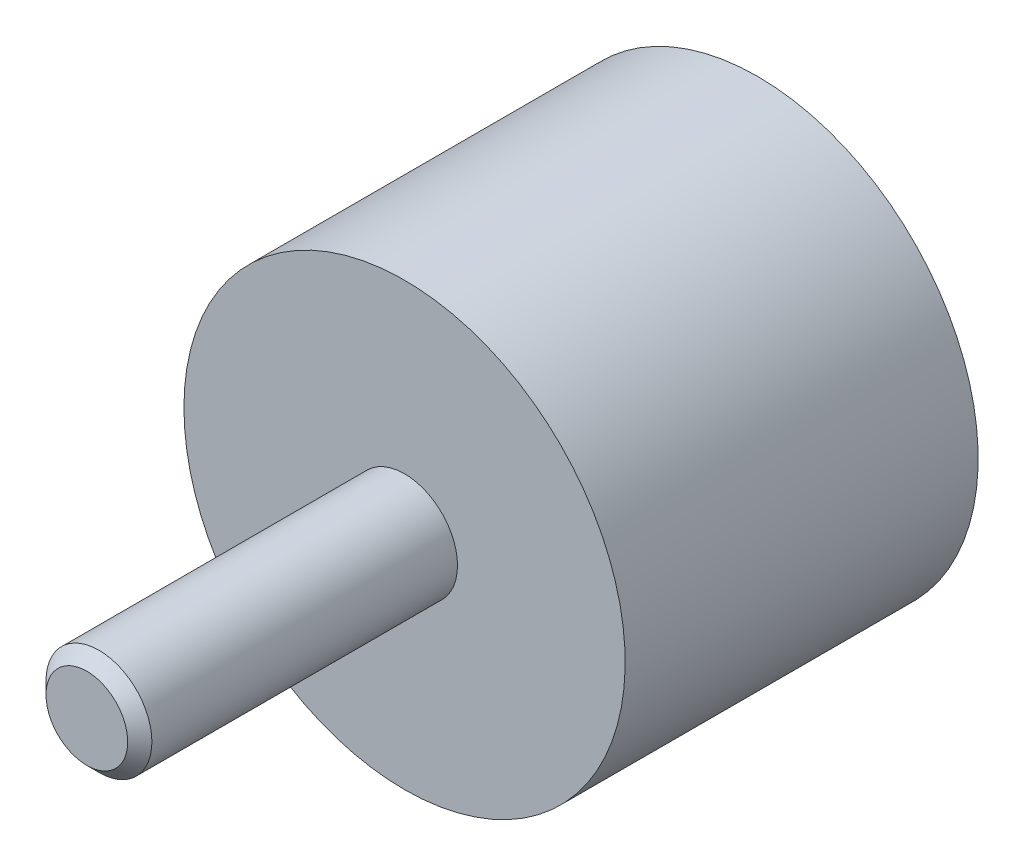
ISO-10303-21;
HEADER;
FILE_DESCRIPTION(('STEP AP214'),'2;1');
FILE_NAME('part.step','',(''),(''),'','','');
FILE_SCHEMA(('AUTOMOTIVE_DESIGN { 1 0 10303 214 1 1 1 1 }'));
ENDSEC;
DATA;
#1=APPLICATION_CONTEXT('core data for automotive mechanical design processes');
#2=APPLICATION_PROTOCOL_DEFINITION('international standard','automotive_design',2000,#1);
#3=PRODUCT_CONTEXT('',#1,'mechanical');
#4=PRODUCT('Part','Part','',(#3));
#5=PRODUCT_RELATED_PRODUCT_CATEGORY('part','',(#4));
#6=PRODUCT_DEFINITION_FORMATION('','',#4);
#7=PRODUCT_DEFINITION_CONTEXT('part definition',#1,'design');
#8=PRODUCT_DEFINITION('design','',#6,#7);
#9=PRODUCT_DEFINITION_SHAPE('','',#8);
#10=(LENGTH_UNIT() NAMED_UNIT(*) SI_UNIT(.MILLI.,.METRE.));
#11=(NAMED_UNIT(*) PLANE_ANGLE_UNIT() SI_UNIT($,.RADIAN.));
#12=(NAMED_UNIT(*) SI_UNIT($,.STERADIAN.) SOLID_ANGLE_UNIT());
#13=UNCERTAINTY_MEASURE_WITH_UNIT(LENGTH_MEASURE(1.E-05),#10,'distance_accuracy_value','');
#14=(GEOMETRIC_REPRESENTATION_CONTEXT(3) GLOBAL_UNCERTAINTY_ASSIGNED_CONTEXT((#13)) GLOBAL_UNIT_ASSIGNED_CONTEXT((#10,
#11,#12)) REPRESENTATION_CONTEXT('',''));
#15=CARTESIAN_POINT('',(0.,0.,0.));
#16=DIRECTION('',(0.,0.,1.));
#17=DIRECTION('',(1.,0.,0.));
#18=AXIS2_PLACEMENT_3D('',#15,#16,#17);
#19=CARTESIAN_POINT('',(0.,0.,0.5));
#20=DIRECTION('',(0.,0.,1.));
#21=DIRECTION('',(0.,-1.,0.));
#22=AXIS2_PLACEMENT_3D('',#19,#20,#21);
#23=CYLINDRICAL_SURFACE('',#22,12.5);
#24=CARTESIAN_POINT('',(0.,0.,0.));
#25=DIRECTION('',(0.,0.,1.));
#26=DIRECTION('',(0.,-1.,0.));
#27=AXIS2_PLACEMENT_3D('',#24,#25,#26);
#28=CIRCLE('',#27,12.5);
#29=CARTESIAN_POINT('',(0.,-12.5,0.));
#30=VERTEX_POINT('',#29);
#31=EDGE_CURVE('E27',#30,#30,#28,.T.);
#32=ORIENTED_EDGE('',*,*,#31,.T.);
#33=EDGE_LOOP('',(#32));
#34=FACE_BOUND('',#33,.T.);
#35=CARTESIAN_POINT('',(0.,0.,20.));
#36=DIRECTION('',(0.,0.,-1.));
#37=DIRECTION('',(-1.,0.,0.));
#38=AXIS2_PLACEMENT_3D('',#35,#36,#37);
#39=CIRCLE('',#38,12.5);
#40=CARTESIAN_POINT('',(-12.5,0.,20.));
#41=VERTEX_POINT('',#40);
#42=EDGE_CURVE('E35',#41,#41,#39,.T.);
#43=ORIENTED_EDGE('',*,*,#42,.T.);
#44=EDGE_LOOP('',(#43));
#45=FACE_BOUND('',#44,.T.);
#46=ADVANCED_FACE('F12',(#34,#45),#23,.T.);
#47=CARTESIAN_POINT('',(12.5,0.,0.));
#48=DIRECTION('',(0.,0.,-1.));
#49=DIRECTION('',(0.,1.,0.));
#50=AXIS2_PLACEMENT_3D('',#47,#48,#49);
#51=PLANE('',#50);
#52=CARTESIAN_POINT('',(0.,0.,0.));
#53=DIRECTION('',(0.,0.,-1.));
#54=DIRECTION('',(0.,1.,0.));
#55=AXIS2_PLACEMENT_3D('',#52,#53,#54);
#56=CIRCLE('',#55,3.45);
#57=CARTESIAN_POINT('',(0.,3.45,0.));
#58=VERTEX_POINT('',#57);
#59=EDGE_CURVE('E19',#58,#58,#56,.F.);
#60=ORIENTED_EDGE('',*,*,#59,.T.);
#61=EDGE_LOOP('',(#60));
#62=FACE_BOUND('',#61,.T.);
#63=ORIENTED_EDGE('',*,*,#31,.F.);
#64=EDGE_LOOP('',(#63));
#65=FACE_BOUND('',#64,.T.);
#66=ADVANCED_FACE('F58',(#62,#65),#51,.T.);
#67=CARTESIAN_POINT('',(0.,0.,0.));
#68=DIRECTION('',(0.,0.,1.));
#69=DIRECTION('',(0.,-1.,0.));
#70=AXIS2_PLACEMENT_3D('',#67,#68,#69);
#71=CYLINDRICAL_SURFACE('',#70,3.);
#72=CARTESIAN_POINT('',(0.,0.,0.45));
#73=DIRECTION('',(0.,0.,-1.));
#74=DIRECTION('',(0.,1.,0.));
#75=AXIS2_PLACEMENT_3D('',#72,#73,#74);
#76=CIRCLE('',#75,3.);
#77=CARTESIAN_POINT('',(0.,3.,0.45));
#78=VERTEX_POINT('',#77);
#79=EDGE_CURVE('E23',#78,#78,#76,.T.);
#80=ORIENTED_EDGE('',*,*,#79,.T.);
#81=EDGE_LOOP('',(#80));
#82=FACE_BOUND('',#81,.T.);
#83=CARTESIAN_POINT('',(0.,0.,6.));
#84=DIRECTION('',(0.,0.,-1.));
#85=DIRECTION('',(0.,1.,0.));
#86=AXIS2_PLACEMENT_3D('',#83,#84,#85);
#87=CIRCLE('',#86,3.);
#88=CARTESIAN_POINT('',(0.,3.,6.));
#89=VERTEX_POINT('',#88);
#90=EDGE_CURVE('E32',#89,#89,#87,.T.);
#91=ORIENTED_EDGE('',*,*,#90,.F.);
#92=EDGE_LOOP('',(#91));
#93=FACE_BOUND('',#92,.T.);
#94=ADVANCED_FACE('F63',(#82,#93),#71,.F.);
#95=CARTESIAN_POINT('',(0.,0.,6.));
#96=DIRECTION('',(0.,0.,-1.));
#97=DIRECTION('',(0.,1.,0.));
#98=AXIS2_PLACEMENT_3D('',#95,#96,#97);
#99=PLANE('',#98);
#100=ORIENTED_EDGE('',*,*,#90,.T.);
#101=EDGE_LOOP('',(#100));
#102=FACE_BOUND('',#101,.T.);
#103=ADVANCED_FACE('F69',(#102),#99,.T.);
#104=CARTESIAN_POINT('',(0.,0.,0.45));
#105=DIRECTION('',(0.,0.,-1.));
#106=DIRECTION('',(0.,1.,0.));
#107=AXIS2_PLACEMENT_3D('',#104,#105,#106);
#108=CONICAL_SURFACE('',#107,3.,0.785398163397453);
#109=ORIENTED_EDGE('',*,*,#59,.F.);
#110=EDGE_LOOP('',(#109));
#111=FACE_BOUND('',#110,.T.);
#112=ORIENTED_EDGE('',*,*,#79,.F.);
#113=EDGE_LOOP('',(#112));
#114=FACE_BOUND('',#113,.T.);
#115=ADVANCED_FACE('F14',(#111,#114),#108,.F.);
#116=CARTESIAN_POINT('',(0.,12.5,20.));
#117=DIRECTION('',(0.,0.,1.));
#118=DIRECTION('',(1.,0.,0.));
#119=AXIS2_PLACEMENT_3D('',#116,#117,#118);
#120=PLANE('',#119);
#121=CARTESIAN_POINT('',(0.,0.,20.));
#122=DIRECTION('',(0.,0.,1.));
#123=DIRECTION('',(1.,0.,0.));
#124=AXIS2_PLACEMENT_3D('',#121,#122,#123);
#125=CIRCLE('',#124,3.);
#126=CARTESIAN_POINT('',(3.,0.,20.));
#127=VERTEX_POINT('',#126);
#128=EDGE_CURVE('E8',#127,#127,#125,.F.);
#129=ORIENTED_EDGE('',*,*,#128,.T.);
#130=EDGE_LOOP('',(#129));
#131=FACE_BOUND('',#130,.T.);
#132=ORIENTED_EDGE('',*,*,#42,.F.);
#133=EDGE_LOOP('',(#132));
#134=FACE_BOUND('',#133,.T.);
#135=ADVANCED_FACE('F73',(#131,#134),#120,.T.);
#136=CARTESIAN_POINT('',(0.,0.,15.));
#137=DIRECTION('',(0.,0.,1.));
#138=DIRECTION('',(0.,-1.,0.));
#139=AXIS2_PLACEMENT_3D('',#136,#137,#138);
#140=CYLINDRICAL_SURFACE('',#139,3.);
#141=ORIENTED_EDGE('',*,*,#128,.F.);
#142=EDGE_LOOP('',(#141));
#143=FACE_BOUND('',#142,.T.);
#144=CARTESIAN_POINT('',(0.,0.,37.3144942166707));
#145=DIRECTION('',(0.,0.,-1.));
#146=DIRECTION('',(-1.,0.,0.));
#147=AXIS2_PLACEMENT_3D('',#144,#145,#146);
#148=CIRCLE('',#147,3.);
#149=CARTESIAN_POINT('',(-3.,0.,37.3144942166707));
#150=VERTEX_POINT('',#149);
#151=EDGE_CURVE('E38',#150,#150,#148,.T.);
#152=ORIENTED_EDGE('',*,*,#151,.T.);
#153=EDGE_LOOP('',(#152));
#154=FACE_BOUND('',#153,.T.);
#155=ADVANCED_FACE('F55',(#143,#154),#140,.T.);
#156=CARTESIAN_POINT('',(0.,0.,37.3144942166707));
#157=DIRECTION('',(0.,0.,-1.));
#158=DIRECTION('',(-1.,0.,0.));
#159=AXIS2_PLACEMENT_3D('',#156,#157,#158);
#160=CONICAL_SURFACE('',#159,3.,0.785398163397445);
#161=CARTESIAN_POINT('',(0.,0.,38.));
#162=DIRECTION('',(0.,0.,-1.));
#163=DIRECTION('',(-1.,0.,0.));
#164=AXIS2_PLACEMENT_3D('',#161,#162,#163);
#165=CIRCLE('',#164,2.3144942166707);
#166=CARTESIAN_POINT('',(-2.3144942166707,0.,38.));
#167=VERTEX_POINT('',#166);
#168=EDGE_CURVE('E41',#167,#167,#165,.T.);
#169=ORIENTED_EDGE('',*,*,#168,.T.);
#170=EDGE_LOOP('',(#169));
#171=FACE_BOUND('',#170,.T.);
#172=ORIENTED_EDGE('',*,*,#151,.F.);
#173=EDGE_LOOP('',(#172));
#174=FACE_BOUND('',#173,.T.);
#175=ADVANCED_FACE('F45',(#171,#174),#160,.T.);
#176=CARTESIAN_POINT('',(0.,2.3144942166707,38.));
#177=DIRECTION('',(0.,0.,1.));
#178=DIRECTION('',(1.,0.,0.));
#179=AXIS2_PLACEMENT_3D('',#176,#177,#178);
#180=PLANE('',#179);
#181=ORIENTED_EDGE('',*,*,#168,.F.);
#182=EDGE_LOOP('',(#181));
#183=FACE_BOUND('',#182,.T.);
#184=ADVANCED_FACE('F48',(#183),#180,.T.);
#185=CLOSED_SHELL('',(#46,#66,#94,#103,#115,#135,#155,#175,#184));
#186=MANIFOLD_SOLID_BREP('B1',#185);
#187=ADVANCED_BREP_SHAPE_REPRESENTATION('',(#18,#186),#14);
#188=SHAPE_DEFINITION_REPRESENTATION(#9,#187);
ENDSEC;
END-ISO-10303-21;
